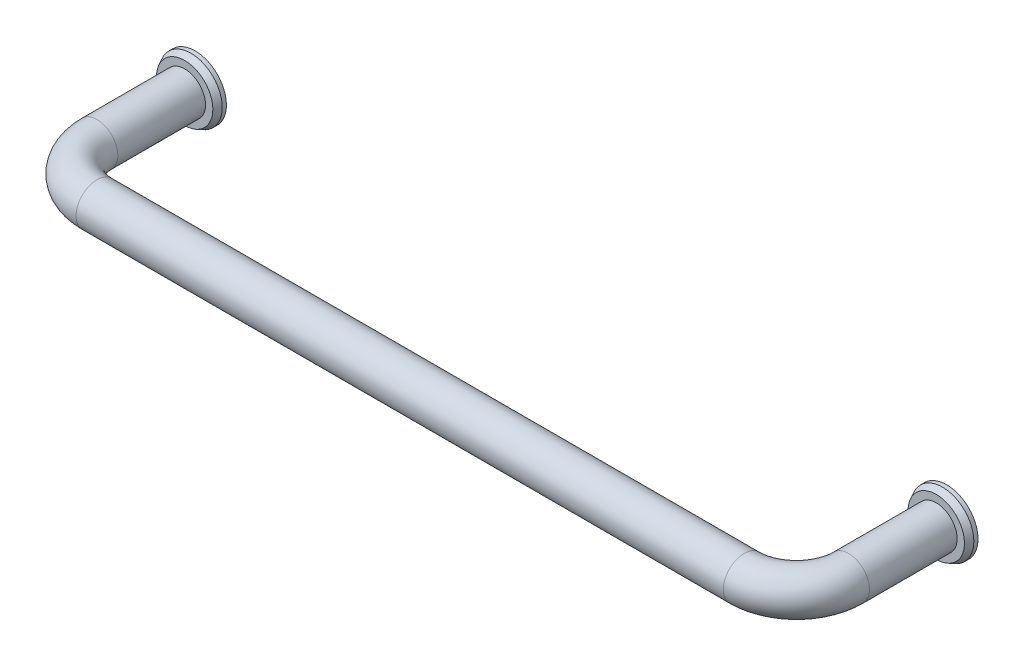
ISO-10303-21;
HEADER;
FILE_DESCRIPTION(('STEP AP214'),'2;1');
FILE_NAME('part.step','',(''),(''),'','','');
FILE_SCHEMA(('AUTOMOTIVE_DESIGN { 1 0 10303 214 1 1 1 1 }'));
ENDSEC;
DATA;
#1=APPLICATION_CONTEXT('core data for automotive mechanical design processes');
#2=APPLICATION_PROTOCOL_DEFINITION('international standard','automotive_design',2000,#1);
#3=PRODUCT_CONTEXT('',#1,'mechanical');
#4=PRODUCT('Part','Part','',(#3));
#5=PRODUCT_RELATED_PRODUCT_CATEGORY('part','',(#4));
#6=PRODUCT_DEFINITION_FORMATION('','',#4);
#7=PRODUCT_DEFINITION_CONTEXT('part definition',#1,'design');
#8=PRODUCT_DEFINITION('design','',#6,#7);
#9=PRODUCT_DEFINITION_SHAPE('','',#8);
#10=(LENGTH_UNIT() NAMED_UNIT(*) SI_UNIT(.MILLI.,.METRE.));
#11=(NAMED_UNIT(*) PLANE_ANGLE_UNIT() SI_UNIT($,.RADIAN.));
#12=(NAMED_UNIT(*) SI_UNIT($,.STERADIAN.) SOLID_ANGLE_UNIT());
#13=UNCERTAINTY_MEASURE_WITH_UNIT(LENGTH_MEASURE(1.E-05),#10,'distance_accuracy_value','');
#14=(GEOMETRIC_REPRESENTATION_CONTEXT(3) GLOBAL_UNCERTAINTY_ASSIGNED_CONTEXT((#13)) GLOBAL_UNIT_ASSIGNED_CONTEXT((#10,
#11,#12)) REPRESENTATION_CONTEXT('',''));
#15=CARTESIAN_POINT('',(0.,0.,0.));
#16=DIRECTION('',(0.,0.,1.));
#17=DIRECTION('',(1.,0.,0.));
#18=AXIS2_PLACEMENT_3D('',#15,#16,#17);
#19=CARTESIAN_POINT('',(0.,0.,0.));
#20=DIRECTION('',(0.,0.,-1.));
#21=DIRECTION('',(0.,1.,0.));
#22=AXIS2_PLACEMENT_3D('',#19,#20,#21);
#23=PLANE('',#22);
#24=CARTESIAN_POINT('',(0.,0.,0.));
#25=DIRECTION('',(0.,0.,1.));
#26=DIRECTION('',(0.,-1.,0.));
#27=AXIS2_PLACEMENT_3D('',#24,#25,#26);
#28=CIRCLE('',#27,7.5);
#29=CARTESIAN_POINT('',(0.,-7.5,0.));
#30=VERTEX_POINT('',#29);
#31=EDGE_CURVE('E56',#30,#30,#28,.T.);
#32=ORIENTED_EDGE('',*,*,#31,.F.);
#33=EDGE_LOOP('',(#32));
#34=FACE_BOUND('',#33,.T.);
#35=CARTESIAN_POINT('',(0.,0.,0.));
#36=DIRECTION('',(0.,0.,1.));
#37=DIRECTION('',(0.,-1.,0.));
#38=AXIS2_PLACEMENT_3D('',#35,#36,#37);
#39=CIRCLE('',#38,2.5);
#40=CARTESIAN_POINT('',(0.,-2.5,0.));
#41=VERTEX_POINT('',#40);
#42=EDGE_CURVE('E62',#41,#41,#39,.T.);
#43=ORIENTED_EDGE('',*,*,#42,.T.);
#44=EDGE_LOOP('',(#43));
#45=FACE_BOUND('',#44,.T.);
#46=ADVANCED_FACE('F12',(#34,#45),#23,.T.);
#47=CARTESIAN_POINT('',(0.,0.,23.5));
#48=DIRECTION('',(0.,0.,-1.));
#49=DIRECTION('',(0.,-1.,0.));
#50=AXIS2_PLACEMENT_3D('',#47,#48,#49);
#51=CYLINDRICAL_SURFACE('',#50,5.);
#52=CARTESIAN_POINT('',(0.,0.,23.5));
#53=DIRECTION('',(0.,0.,-1.));
#54=DIRECTION('',(0.,1.,0.));
#55=AXIS2_PLACEMENT_3D('',#52,#53,#54);
#56=CIRCLE('',#55,5.);
#57=CARTESIAN_POINT('',(-5.,0.,23.5));
#58=VERTEX_POINT('',#57);
#59=EDGE_CURVE('E20',#58,#58,#56,.T.);
#60=ORIENTED_EDGE('',*,*,#59,.T.);
#61=EDGE_LOOP('',(#60));
#62=FACE_BOUND('',#61,.T.);
#63=CARTESIAN_POINT('',(0.,0.,2.5));
#64=DIRECTION('',(0.,0.,-1.));
#65=DIRECTION('',(0.,-1.,0.));
#66=AXIS2_PLACEMENT_3D('',#63,#64,#65);
#67=CIRCLE('',#66,5.);
#68=CARTESIAN_POINT('',(0.,-5.,2.5));
#69=VERTEX_POINT('',#68);
#70=EDGE_CURVE('E16',#69,#69,#67,.F.);
#71=ORIENTED_EDGE('',*,*,#70,.T.);
#72=EDGE_LOOP('',(#71));
#73=FACE_BOUND('',#72,.T.);
#74=ADVANCED_FACE('F14',(#62,#73),#51,.T.);
#75=CARTESIAN_POINT('',(180.,0.,23.5));
#76=DIRECTION('',(0.,0.,-1.));
#77=DIRECTION('',(0.,-1.,0.));
#78=AXIS2_PLACEMENT_3D('',#75,#76,#77);
#79=CYLINDRICAL_SURFACE('',#78,5.);
#80=CARTESIAN_POINT('',(180.,0.,23.5));
#81=DIRECTION('',(0.,0.,1.));
#82=DIRECTION('',(0.,1.,0.));
#83=AXIS2_PLACEMENT_3D('',#80,#81,#82);
#84=CIRCLE('',#83,5.);
#85=CARTESIAN_POINT('',(185.,0.,23.5));
#86=VERTEX_POINT('',#85);
#87=EDGE_CURVE('E32',#86,#86,#84,.T.);
#88=ORIENTED_EDGE('',*,*,#87,.F.);
#89=EDGE_LOOP('',(#88));
#90=FACE_BOUND('',#89,.T.);
#91=CARTESIAN_POINT('',(180.,0.,2.5));
#92=DIRECTION('',(0.,0.,-1.));
#93=DIRECTION('',(0.,-1.,0.));
#94=AXIS2_PLACEMENT_3D('',#91,#92,#93);
#95=CIRCLE('',#94,5.);
#96=CARTESIAN_POINT('',(180.,-5.,2.5));
#97=VERTEX_POINT('',#96);
#98=EDGE_CURVE('E8',#97,#97,#95,.T.);
#99=ORIENTED_EDGE('',*,*,#98,.F.);
#100=EDGE_LOOP('',(#99));
#101=FACE_BOUND('',#100,.T.);
#102=ADVANCED_FACE('F91',(#90,#101),#79,.T.);
#103=CARTESIAN_POINT('',(12.5,0.,23.5));
#104=DIRECTION('',(0.,-1.,0.));
#105=DIRECTION('',(1.,0.,0.));
#106=AXIS2_PLACEMENT_3D('',#103,#104,#105);
#107=TOROIDAL_SURFACE('',#106,12.5,5.);
#108=CARTESIAN_POINT('',(12.5,0.,36.));
#109=DIRECTION('',(-1.,0.,0.));
#110=DIRECTION('',(0.,1.,0.));
#111=AXIS2_PLACEMENT_3D('',#108,#109,#110);
#112=CIRCLE('',#111,5.);
#113=CARTESIAN_POINT('',(12.5,0.,41.));
#114=VERTEX_POINT('',#113);
#115=EDGE_CURVE('E24',#114,#114,#112,.T.);
#116=CARTESIAN_POINT('',(12.5,0.,23.5));
#117=DIRECTION('',(0.,-1.,0.));
#118=DIRECTION('',(1.,0.,0.));
#119=AXIS2_PLACEMENT_3D('',#116,#117,#118);
#120=CIRCLE('',#119,17.5);
#121=EDGE_CURVE('',#114,#58,#120,.T.);
#122=ORIENTED_EDGE('',*,*,#115,.T.);
#123=ORIENTED_EDGE('',*,*,#59,.F.);
#124=ORIENTED_EDGE('',*,*,#121,.T.);
#125=ORIENTED_EDGE('',*,*,#121,.F.);
#126=EDGE_LOOP('',(#122,#124,#123,#125));
#127=FACE_BOUND('',#126,.T.);
#128=ADVANCED_FACE('F100',(#127),#107,.T.);
#129=CARTESIAN_POINT('',(167.5,0.,36.));
#130=DIRECTION('',(-1.,0.,0.));
#131=DIRECTION('',(0.,0.,1.));
#132=AXIS2_PLACEMENT_3D('',#129,#130,#131);
#133=CYLINDRICAL_SURFACE('',#132,5.);
#134=CARTESIAN_POINT('',(167.5,0.,36.));
#135=DIRECTION('',(-1.,0.,0.));
#136=DIRECTION('',(0.,1.,0.));
#137=AXIS2_PLACEMENT_3D('',#134,#135,#136);
#138=CIRCLE('',#137,5.);
#139=CARTESIAN_POINT('',(167.5,0.,41.));
#140=VERTEX_POINT('',#139);
#141=EDGE_CURVE('E29',#140,#140,#138,.T.);
#142=ORIENTED_EDGE('',*,*,#141,.T.);
#143=EDGE_LOOP('',(#142));
#144=FACE_BOUND('',#143,.T.);
#145=ORIENTED_EDGE('',*,*,#115,.F.);
#146=EDGE_LOOP('',(#145));
#147=FACE_BOUND('',#146,.T.);
#148=ADVANCED_FACE('F106',(#144,#147),#133,.T.);
#149=CARTESIAN_POINT('',(167.5,0.,23.5));
#150=DIRECTION('',(0.,-1.,0.));
#151=DIRECTION('',(1.,0.,0.));
#152=AXIS2_PLACEMENT_3D('',#149,#150,#151);
#153=TOROIDAL_SURFACE('',#152,12.5,5.);
#154=CARTESIAN_POINT('',(167.5,0.,23.5));
#155=DIRECTION('',(0.,-1.,0.));
#156=DIRECTION('',(1.,0.,0.));
#157=AXIS2_PLACEMENT_3D('',#154,#155,#156);
#158=CIRCLE('',#157,17.5);
#159=EDGE_CURVE('',#86,#140,#158,.T.);
#160=ORIENTED_EDGE('',*,*,#87,.T.);
#161=ORIENTED_EDGE('',*,*,#141,.F.);
#162=ORIENTED_EDGE('',*,*,#159,.T.);
#163=ORIENTED_EDGE('',*,*,#159,.F.);
#164=EDGE_LOOP('',(#160,#162,#161,#163));
#165=FACE_BOUND('',#164,.T.);
#166=ADVANCED_FACE('F102',(#165),#153,.T.);
#167=CARTESIAN_POINT('',(180.,0.,2.5));
#168=DIRECTION('',(0.,0.,-1.));
#169=DIRECTION('',(0.,-1.,0.));
#170=AXIS2_PLACEMENT_3D('',#167,#168,#169);
#171=PLANE('',#170);
#172=CARTESIAN_POINT('',(180.,0.,2.5));
#173=DIRECTION('',(0.,0.,-1.));
#174=DIRECTION('',(0.,-1.,0.));
#175=AXIS2_PLACEMENT_3D('',#172,#173,#174);
#176=CIRCLE('',#175,6.75);
#177=CARTESIAN_POINT('',(180.,-6.75,2.5));
#178=VERTEX_POINT('',#177);
#179=EDGE_CURVE('E35',#178,#178,#176,.T.);
#180=ORIENTED_EDGE('',*,*,#179,.F.);
#181=EDGE_LOOP('',(#180));
#182=FACE_BOUND('',#181,.T.);
#183=ORIENTED_EDGE('',*,*,#98,.T.);
#184=EDGE_LOOP('',(#183));
#185=FACE_BOUND('',#184,.T.);
#186=ADVANCED_FACE('F105',(#182,#185),#171,.F.);
#187=CARTESIAN_POINT('',(180.,0.,2.5));
#188=DIRECTION('',(0.,0.,-1.));
#189=DIRECTION('',(0.,-1.,0.));
#190=AXIS2_PLACEMENT_3D('',#187,#188,#189);
#191=CONICAL_SURFACE('',#190,6.75,0.463647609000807);
#192=CARTESIAN_POINT('',(180.,0.,0.999999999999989));
#193=DIRECTION('',(0.,0.,-1.));
#194=DIRECTION('',(0.,-1.,0.));
#195=AXIS2_PLACEMENT_3D('',#192,#193,#194);
#196=CIRCLE('',#195,7.5);
#197=CARTESIAN_POINT('',(180.,-7.5,0.999999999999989));
#198=VERTEX_POINT('',#197);
#199=EDGE_CURVE('E38',#198,#198,#196,.T.);
#200=ORIENTED_EDGE('',*,*,#199,.F.);
#201=EDGE_LOOP('',(#200));
#202=FACE_BOUND('',#201,.T.);
#203=ORIENTED_EDGE('',*,*,#179,.T.);
#204=EDGE_LOOP('',(#203));
#205=FACE_BOUND('',#204,.T.);
#206=ADVANCED_FACE('F146',(#202,#205),#191,.T.);
#207=CARTESIAN_POINT('',(180.,0.,0.));
#208=DIRECTION('',(0.,0.,-1.));
#209=DIRECTION('',(0.,-1.,0.));
#210=AXIS2_PLACEMENT_3D('',#207,#208,#209);
#211=CYLINDRICAL_SURFACE('',#210,7.5);
#212=CARTESIAN_POINT('',(180.,0.,0.));
#213=DIRECTION('',(0.,0.,-1.));
#214=DIRECTION('',(0.,-1.,0.));
#215=AXIS2_PLACEMENT_3D('',#212,#213,#214);
#216=CIRCLE('',#215,7.5);
#217=CARTESIAN_POINT('',(180.,-7.5,0.));
#218=VERTEX_POINT('',#217);
#219=EDGE_CURVE('E41',#218,#218,#216,.T.);
#220=ORIENTED_EDGE('',*,*,#219,.F.);
#221=EDGE_LOOP('',(#220));
#222=FACE_BOUND('',#221,.T.);
#223=ORIENTED_EDGE('',*,*,#199,.T.);
#224=EDGE_LOOP('',(#223));
#225=FACE_BOUND('',#224,.T.);
#226=ADVANCED_FACE('F143',(#222,#225),#211,.T.);
#227=CARTESIAN_POINT('',(180.,0.,0.));
#228=DIRECTION('',(0.,0.,1.));
#229=DIRECTION('',(0.,1.,0.));
#230=AXIS2_PLACEMENT_3D('',#227,#228,#229);
#231=PLANE('',#230);
#232=CARTESIAN_POINT('',(180.,0.,0.));
#233=DIRECTION('',(0.,0.,-1.));
#234=DIRECTION('',(0.,-1.,0.));
#235=AXIS2_PLACEMENT_3D('',#232,#233,#234);
#236=CIRCLE('',#235,2.5);
#237=CARTESIAN_POINT('',(180.,-2.5,0.));
#238=VERTEX_POINT('',#237);
#239=EDGE_CURVE('E47',#238,#238,#236,.T.);
#240=ORIENTED_EDGE('',*,*,#239,.F.);
#241=EDGE_LOOP('',(#240));
#242=FACE_BOUND('',#241,.T.);
#243=ORIENTED_EDGE('',*,*,#219,.T.);
#244=EDGE_LOOP('',(#243));
#245=FACE_BOUND('',#244,.T.);
#246=ADVANCED_FACE('F96',(#242,#245),#231,.F.);
#247=CARTESIAN_POINT('',(180.,0.,11.));
#248=DIRECTION('',(0.,0.,-1.));
#249=DIRECTION('',(0.,-1.,0.));
#250=AXIS2_PLACEMENT_3D('',#247,#248,#249);
#251=CYLINDRICAL_SURFACE('',#250,2.5);
#252=CARTESIAN_POINT('',(180.,0.,11.));
#253=DIRECTION('',(0.,0.,-1.));
#254=DIRECTION('',(0.,-1.,0.));
#255=AXIS2_PLACEMENT_3D('',#252,#253,#254);
#256=CIRCLE('',#255,2.5);
#257=CARTESIAN_POINT('',(180.,-2.5,11.));
#258=VERTEX_POINT('',#257);
#259=EDGE_CURVE('E44',#258,#258,#256,.T.);
#260=ORIENTED_EDGE('',*,*,#259,.F.);
#261=EDGE_LOOP('',(#260));
#262=FACE_BOUND('',#261,.T.);
#263=ORIENTED_EDGE('',*,*,#239,.T.);
#264=EDGE_LOOP('',(#263));
#265=FACE_BOUND('',#264,.T.);
#266=ADVANCED_FACE('F127',(#262,#265),#251,.F.);
#267=CARTESIAN_POINT('',(180.,0.,11.));
#268=DIRECTION('',(0.,0.,-1.));
#269=DIRECTION('',(0.,-1.,0.));
#270=AXIS2_PLACEMENT_3D('',#267,#268,#269);
#271=PLANE('',#270);
#272=ORIENTED_EDGE('',*,*,#259,.T.);
#273=EDGE_LOOP('',(#272));
#274=FACE_BOUND('',#273,.T.);
#275=ADVANCED_FACE('F125',(#274),#271,.T.);
#276=CARTESIAN_POINT('',(0.,0.,2.5));
#277=DIRECTION('',(0.,0.,-1.));
#278=DIRECTION('',(0.,-1.,0.));
#279=AXIS2_PLACEMENT_3D('',#276,#277,#278);
#280=PLANE('',#279);
#281=ORIENTED_EDGE('',*,*,#70,.F.);
#282=EDGE_LOOP('',(#281));
#283=FACE_BOUND('',#282,.T.);
#284=CARTESIAN_POINT('',(0.,0.,2.5));
#285=DIRECTION('',(0.,0.,1.));
#286=DIRECTION('',(0.,-1.,0.));
#287=AXIS2_PLACEMENT_3D('',#284,#285,#286);
#288=CIRCLE('',#287,6.75);
#289=CARTESIAN_POINT('',(0.,-6.75,2.5));
#290=VERTEX_POINT('',#289);
#291=EDGE_CURVE('E50',#290,#290,#288,.T.);
#292=ORIENTED_EDGE('',*,*,#291,.T.);
#293=EDGE_LOOP('',(#292));
#294=FACE_BOUND('',#293,.T.);
#295=ADVANCED_FACE('F122',(#283,#294),#280,.F.);
#296=CARTESIAN_POINT('',(0.,0.,2.5));
#297=DIRECTION('',(0.,0.,-1.));
#298=DIRECTION('',(0.,-1.,0.));
#299=AXIS2_PLACEMENT_3D('',#296,#297,#298);
#300=CONICAL_SURFACE('',#299,6.75,0.463647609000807);
#301=CARTESIAN_POINT('',(0.,0.,0.999999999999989));
#302=DIRECTION('',(0.,0.,1.));
#303=DIRECTION('',(0.,-1.,0.));
#304=AXIS2_PLACEMENT_3D('',#301,#302,#303);
#305=CIRCLE('',#304,7.5);
#306=CARTESIAN_POINT('',(0.,-7.5,0.999999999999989));
#307=VERTEX_POINT('',#306);
#308=EDGE_CURVE('E53',#307,#307,#305,.T.);
#309=ORIENTED_EDGE('',*,*,#308,.T.);
#310=EDGE_LOOP('',(#309));
#311=FACE_BOUND('',#310,.T.);
#312=ORIENTED_EDGE('',*,*,#291,.F.);
#313=EDGE_LOOP('',(#312));
#314=FACE_BOUND('',#313,.T.);
#315=ADVANCED_FACE('F81',(#311,#314),#300,.T.);
#316=CARTESIAN_POINT('',(0.,0.,0.));
#317=DIRECTION('',(0.,0.,-1.));
#318=DIRECTION('',(0.,-1.,0.));
#319=AXIS2_PLACEMENT_3D('',#316,#317,#318);
#320=CYLINDRICAL_SURFACE('',#319,7.5);
#321=ORIENTED_EDGE('',*,*,#31,.T.);
#322=EDGE_LOOP('',(#321));
#323=FACE_BOUND('',#322,.T.);
#324=ORIENTED_EDGE('',*,*,#308,.F.);
#325=EDGE_LOOP('',(#324));
#326=FACE_BOUND('',#325,.T.);
#327=ADVANCED_FACE('F70',(#323,#326),#320,.T.);
#328=CARTESIAN_POINT('',(0.,0.,11.));
#329=DIRECTION('',(0.,0.,-1.));
#330=DIRECTION('',(0.,-1.,0.));
#331=AXIS2_PLACEMENT_3D('',#328,#329,#330);
#332=CYLINDRICAL_SURFACE('',#331,2.5);
#333=CARTESIAN_POINT('',(0.,0.,11.));
#334=DIRECTION('',(0.,0.,1.));
#335=DIRECTION('',(0.,-1.,0.));
#336=AXIS2_PLACEMENT_3D('',#333,#334,#335);
#337=CIRCLE('',#336,2.5);
#338=CARTESIAN_POINT('',(0.,-2.5,11.));
#339=VERTEX_POINT('',#338);
#340=EDGE_CURVE('E59',#339,#339,#337,.T.);
#341=ORIENTED_EDGE('',*,*,#340,.T.);
#342=EDGE_LOOP('',(#341));
#343=FACE_BOUND('',#342,.T.);
#344=ORIENTED_EDGE('',*,*,#42,.F.);
#345=EDGE_LOOP('',(#344));
#346=FACE_BOUND('',#345,.T.);
#347=ADVANCED_FACE('F67',(#343,#346),#332,.F.);
#348=CARTESIAN_POINT('',(0.,0.,11.));
#349=DIRECTION('',(0.,0.,-1.));
#350=DIRECTION('',(0.,-1.,0.));
#351=AXIS2_PLACEMENT_3D('',#348,#349,#350);
#352=PLANE('',#351);
#353=ORIENTED_EDGE('',*,*,#340,.F.);
#354=EDGE_LOOP('',(#353));
#355=FACE_BOUND('',#354,.T.);
#356=ADVANCED_FACE('F69',(#355),#352,.T.);
#357=CLOSED_SHELL('',(#46,#74,#102,#128,#148,#166,#186,#206,#226,#246,#266,#275,#295,#315,#327,
#347,#356));
#358=MANIFOLD_SOLID_BREP('B1',#357);
#359=ADVANCED_BREP_SHAPE_REPRESENTATION('',(#18,#358),#14);
#360=SHAPE_DEFINITION_REPRESENTATION(#9,#359);
ENDSEC;
END-ISO-10303-21;
